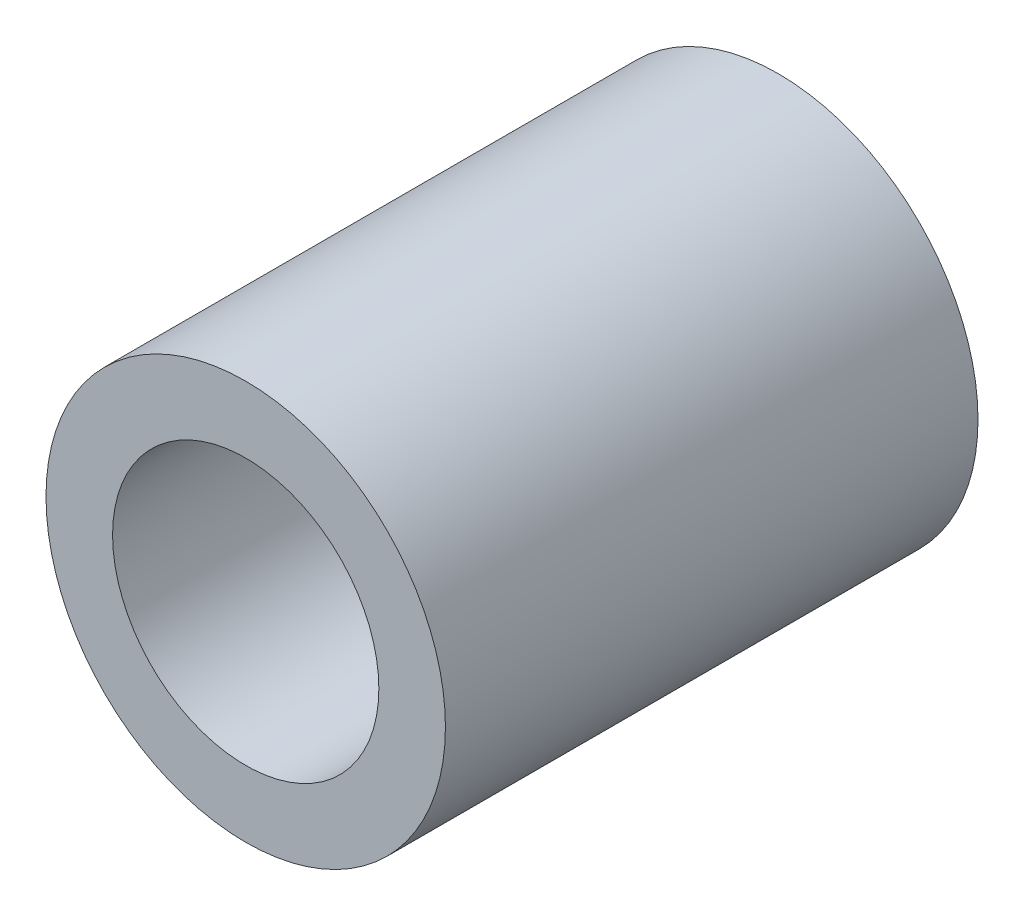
from build123d import *

# Parameters (mm, degrees)
SKETCH1_R          = 15
EXTRUDE1_DEPTH     = 20
SKETCH2_R          = 10
CUT_EXTRUDE1_DEPTH = 46.276925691


with BuildPart() as part:
    # Sketch1 → Extrude1 (new, symmetric)
    with BuildSketch(Plane.XY):
        Circle(SKETCH1_R)
    extrude(amount=EXTRUDE1_DEPTH, both=True)

    # Sketch2 → Cut-Extrude1 (cut, through all)
    with BuildSketch(Plane.XY.offset(20)):
        Circle(SKETCH2_R)
    extrude(amount=-CUT_EXTRUDE1_DEPTH, mode=Mode.SUBTRACT)


solid = part.part
